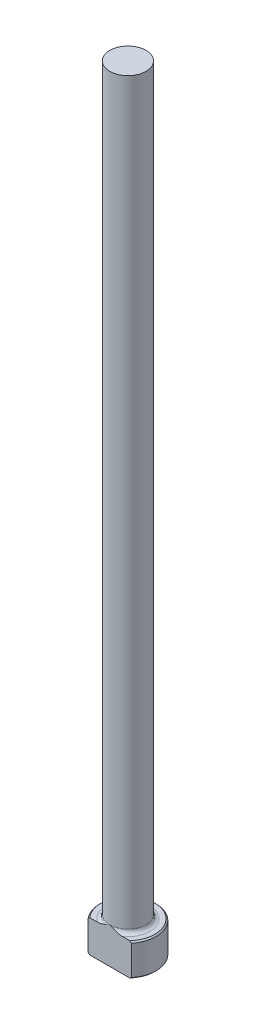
ISO-10303-21;
HEADER;
FILE_DESCRIPTION(('STEP AP214'),'2;1');
FILE_NAME('part.step','',(''),(''),'','','');
FILE_SCHEMA(('AUTOMOTIVE_DESIGN { 1 0 10303 214 1 1 1 1 }'));
ENDSEC;
DATA;
#1=APPLICATION_CONTEXT('core data for automotive mechanical design processes');
#2=APPLICATION_PROTOCOL_DEFINITION('international standard','automotive_design',2000,#1);
#3=PRODUCT_CONTEXT('',#1,'mechanical');
#4=PRODUCT('Part','Part','',(#3));
#5=PRODUCT_RELATED_PRODUCT_CATEGORY('part','',(#4));
#6=PRODUCT_DEFINITION_FORMATION('','',#4);
#7=PRODUCT_DEFINITION_CONTEXT('part definition',#1,'design');
#8=PRODUCT_DEFINITION('design','',#6,#7);
#9=PRODUCT_DEFINITION_SHAPE('','',#8);
#10=(LENGTH_UNIT() NAMED_UNIT(*) SI_UNIT(.MILLI.,.METRE.));
#11=(NAMED_UNIT(*) PLANE_ANGLE_UNIT() SI_UNIT($,.RADIAN.));
#12=(NAMED_UNIT(*) SI_UNIT($,.STERADIAN.) SOLID_ANGLE_UNIT());
#13=UNCERTAINTY_MEASURE_WITH_UNIT(LENGTH_MEASURE(1.E-05),#10,'distance_accuracy_value','');
#14=(GEOMETRIC_REPRESENTATION_CONTEXT(3) GLOBAL_UNCERTAINTY_ASSIGNED_CONTEXT((#13)) GLOBAL_UNIT_ASSIGNED_CONTEXT((#10,
#11,#12)) REPRESENTATION_CONTEXT('',''));
#15=CARTESIAN_POINT('',(0.,0.,0.));
#16=DIRECTION('',(0.,0.,1.));
#17=DIRECTION('',(1.,0.,0.));
#18=AXIS2_PLACEMENT_3D('',#15,#16,#17);
#19=CARTESIAN_POINT('',(0.,0.,0.));
#20=DIRECTION('',(0.,-1.,0.));
#21=DIRECTION('',(0.,0.,-1.));
#22=AXIS2_PLACEMENT_3D('',#19,#20,#21);
#23=PLANE('',#22);
#24=DIRECTION('',(1.,0.,0.));
#25=VECTOR('',#24,1.);
#26=CARTESIAN_POINT('',(-4.24825080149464,0.,3.57123999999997));
#27=LINE('',#26,#25);
#28=CARTESIAN_POINT('',(-3.9106011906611,0.,3.57123999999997));
#29=VERTEX_POINT('',#28);
#30=CARTESIAN_POINT('',(3.9106011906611,0.,3.57123999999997));
#31=VERTEX_POINT('',#30);
#32=EDGE_CURVE('E92',#29,#31,#27,.T.);
#33=ORIENTED_EDGE('',*,*,#32,.F.);
#34=CARTESIAN_POINT('',(0.,0.,0.));
#35=DIRECTION('',(0.,-1.,0.));
#36=DIRECTION('',(0.,0.,-1.));
#37=AXIS2_PLACEMENT_3D('',#34,#35,#36);
#38=CIRCLE('',#37,5.29589999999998);
#39=EDGE_CURVE('E105',#29,#31,#38,.T.);
#40=ORIENTED_EDGE('',*,*,#39,.T.);
#41=EDGE_LOOP('',(#33,#40));
#42=FACE_BOUND('',#41,.T.);
#43=ADVANCED_FACE('F37',(#42),#23,.T.);
#44=CARTESIAN_POINT('',(0.,259.958771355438,0.));
#45=DIRECTION('',(0.,1.,0.));
#46=DIRECTION('',(0.,0.,1.));
#47=AXIS2_PLACEMENT_3D('',#44,#45,#46);
#48=CYLINDRICAL_SURFACE('',#47,5.54989999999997);
#49=DIRECTION('',(0.,-1.,0.));
#50=VECTOR('',#49,1.);
#51=CARTESIAN_POINT('',(-4.24825080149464,152.4,3.57123999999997));
#52=LINE('',#51,#50);
#53=CARTESIAN_POINT('',(-4.24825080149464,6.09599999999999,3.57123999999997));
#54=VERTEX_POINT('',#53);
#55=CARTESIAN_POINT('',(-4.24825080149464,0.253999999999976,3.57123999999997));
#56=VERTEX_POINT('',#55);
#57=EDGE_CURVE('E95',#54,#56,#52,.T.);
#58=ORIENTED_EDGE('',*,*,#57,.F.);
#59=CARTESIAN_POINT('',(0.,6.09599999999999,0.));
#60=DIRECTION('',(0.,1.,0.));
#61=DIRECTION('',(0.,0.,1.));
#62=AXIS2_PLACEMENT_3D('',#59,#60,#61);
#63=CIRCLE('',#62,5.54989999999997);
#64=CARTESIAN_POINT('',(4.24825080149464,6.09599999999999,3.57123999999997));
#65=VERTEX_POINT('',#64);
#66=EDGE_CURVE('E109',#54,#65,#63,.F.);
#67=ORIENTED_EDGE('',*,*,#66,.T.);
#68=DIRECTION('',(0.,-1.,0.));
#69=VECTOR('',#68,1.);
#70=CARTESIAN_POINT('',(4.24825080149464,152.4,3.57123999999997));
#71=LINE('',#70,#69);
#72=CARTESIAN_POINT('',(4.24825080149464,0.253999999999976,3.57123999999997));
#73=VERTEX_POINT('',#72);
#74=EDGE_CURVE('E187',#65,#73,#71,.T.);
#75=ORIENTED_EDGE('',*,*,#74,.T.);
#76=CARTESIAN_POINT('',(0.,0.253999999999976,0.));
#77=DIRECTION('',(0.,-1.,0.));
#78=DIRECTION('',(0.,0.,-1.));
#79=AXIS2_PLACEMENT_3D('',#76,#77,#78);
#80=CIRCLE('',#79,5.54989999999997);
#81=EDGE_CURVE('E115',#73,#56,#80,.F.);
#82=ORIENTED_EDGE('',*,*,#81,.T.);
#83=EDGE_LOOP('',(#58,#67,#75,#82));
#84=FACE_BOUND('',#83,.T.);
#85=ADVANCED_FACE('F160',(#84),#48,.T.);
#86=CARTESIAN_POINT('',(-5.54989999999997,6.35,0.));
#87=DIRECTION('',(0.,1.,0.));
#88=DIRECTION('',(0.,0.,1.));
#89=AXIS2_PLACEMENT_3D('',#86,#87,#88);
#90=PLANE('',#89);
#91=DIRECTION('',(-1.,0.,0.));
#92=VECTOR('',#91,1.);
#93=CARTESIAN_POINT('',(-5.54989999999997,6.35,3.57123999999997));
#94=LINE('',#93,#92);
#95=CARTESIAN_POINT('',(3.91060119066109,6.35,3.57123999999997));
#96=VERTEX_POINT('',#95);
#97=CARTESIAN_POINT('',(2.4542236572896,6.35,3.57123999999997));
#98=VERTEX_POINT('',#97);
#99=EDGE_CURVE('E58',#96,#98,#94,.T.);
#100=ORIENTED_EDGE('',*,*,#99,.F.);
#101=CARTESIAN_POINT('',(0.,6.35,0.));
#102=DIRECTION('',(0.,1.,0.));
#103=DIRECTION('',(0.,0.,1.));
#104=AXIS2_PLACEMENT_3D('',#101,#102,#103);
#105=CIRCLE('',#104,5.29589999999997);
#106=CARTESIAN_POINT('',(-3.91060119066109,6.35,3.57123999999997));
#107=VERTEX_POINT('',#106);
#108=EDGE_CURVE('E182',#96,#107,#105,.T.);
#109=ORIENTED_EDGE('',*,*,#108,.T.);
#110=CARTESIAN_POINT('',(-2.45422365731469,6.35000000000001,3.57123999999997));
#111=VERTEX_POINT('',#110);
#112=EDGE_CURVE('E140',#111,#107,#94,.T.);
#113=ORIENTED_EDGE('',*,*,#112,.F.);
#114=CARTESIAN_POINT('',(0.,6.35,0.));
#115=DIRECTION('',(0.,1.,0.));
#116=DIRECTION('',(0.,0.,1.));
#117=AXIS2_PLACEMENT_3D('',#114,#115,#116);
#118=CIRCLE('',#117,4.33323999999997);
#119=EDGE_CURVE('E112',#111,#98,#118,.F.);
#120=ORIENTED_EDGE('',*,*,#119,.T.);
#121=EDGE_LOOP('',(#100,#109,#113,#120));
#122=FACE_BOUND('',#121,.T.);
#123=ADVANCED_FACE('F164',(#122),#90,.T.);
#124=CARTESIAN_POINT('',(0.,259.958771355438,0.));
#125=DIRECTION('',(0.,1.,0.));
#126=DIRECTION('',(0.,0.,1.));
#127=AXIS2_PLACEMENT_3D('',#124,#125,#126);
#128=CYLINDRICAL_SURFACE('',#127,3.57123999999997);
#129=CARTESIAN_POINT('',(0.,7.11200000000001,0.));
#130=DIRECTION('',(0.,1.,0.));
#131=DIRECTION('',(0.,0.,1.));
#132=AXIS2_PLACEMENT_3D('',#129,#130,#131);
#133=CIRCLE('',#132,3.57123999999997);
#134=CARTESIAN_POINT('',(0.,7.11200000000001,3.57123999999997));
#135=VERTEX_POINT('',#134);
#136=EDGE_CURVE('E108',#135,#135,#133,.T.);
#137=ORIENTED_EDGE('',*,*,#136,.T.);
#138=EDGE_LOOP('',(#137));
#139=FACE_BOUND('',#138,.T.);
#140=CARTESIAN_POINT('',(0.,152.4,0.));
#141=DIRECTION('',(0.,1.,0.));
#142=DIRECTION('',(0.,0.,1.));
#143=AXIS2_PLACEMENT_3D('',#140,#141,#142);
#144=CIRCLE('',#143,3.57123999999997);
#145=CARTESIAN_POINT('',(0.,152.4,3.57123999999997));
#146=VERTEX_POINT('',#145);
#147=EDGE_CURVE('E100',#146,#146,#144,.T.);
#148=ORIENTED_EDGE('',*,*,#147,.F.);
#149=EDGE_LOOP('',(#148));
#150=FACE_BOUND('',#149,.T.);
#151=ADVANCED_FACE('F169',(#139,#150),#128,.T.);
#152=CARTESIAN_POINT('',(-3.57123999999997,152.4,0.));
#153=DIRECTION('',(0.,1.,0.));
#154=DIRECTION('',(0.,0.,1.));
#155=AXIS2_PLACEMENT_3D('',#152,#153,#154);
#156=PLANE('',#155);
#157=ORIENTED_EDGE('',*,*,#147,.T.);
#158=EDGE_LOOP('',(#157));
#159=FACE_BOUND('',#158,.T.);
#160=ADVANCED_FACE('F127',(#159),#156,.T.);
#161=CARTESIAN_POINT('',(0.,6.35000000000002,0.));
#162=DIRECTION('',(0.,-1.,0.));
#163=DIRECTION('',(0.,0.,-1.));
#164=AXIS2_PLACEMENT_3D('',#161,#162,#163);
#165=CONICAL_SURFACE('',#164,5.29589999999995,0.785398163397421);
#166=CARTESIAN_POINT('',(4.24895080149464,6.095464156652,3.57123999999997));
#167=CARTESIAN_POINT('',(4.14438295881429,6.17549355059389,3.57123999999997));
#168=CARTESIAN_POINT('',(4.03923647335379,6.25477935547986,3.57123999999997));
#169=CARTESIAN_POINT('',(3.82754644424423,6.41151858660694,3.57123999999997));
#170=CARTESIAN_POINT('',(3.72100255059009,6.48897153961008,3.57123999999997));
#171=CARTESIAN_POINT('',(3.50542882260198,6.64230038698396,3.57123999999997));
#172=CARTESIAN_POINT('',(3.39638561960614,6.71815755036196,3.57123999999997));
#173=CARTESIAN_POINT('',(3.17642983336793,6.86710220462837,3.57123999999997));
#174=CARTESIAN_POINT('',(3.06551738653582,6.94018989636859,3.57123999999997));
#175=CARTESIAN_POINT('',(2.83424004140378,7.08758688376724,3.57123999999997));
#176=CARTESIAN_POINT('',(2.71372876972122,7.16166773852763,3.57123999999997));
#177=CARTESIAN_POINT('',(2.46979024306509,7.30494728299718,3.57123999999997));
#178=CARTESIAN_POINT('',(2.34636247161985,7.37414509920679,3.57123999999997));
#179=CARTESIAN_POINT('',(2.09658186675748,7.5060691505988,3.57123999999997));
#180=CARTESIAN_POINT('',(1.9702398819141,7.56881574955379,3.57123999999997));
#181=CARTESIAN_POINT('',(1.7139227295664,7.68631362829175,3.57123999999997));
#182=CARTESIAN_POINT('',(1.58394942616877,7.74106892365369,3.57123999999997));
#183=CARTESIAN_POINT('',(1.32618995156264,7.83815050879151,3.57123999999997));
#184=CARTESIAN_POINT('',(1.19857765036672,7.88093225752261,3.57123999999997));
#185=CARTESIAN_POINT('',(0.940022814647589,7.95508927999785,3.57123999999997));
#186=CARTESIAN_POINT('',(0.809080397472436,7.98646495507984,3.57123999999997));
#187=CARTESIAN_POINT('',(0.547472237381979,8.0351736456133,3.57123999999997));
#188=CARTESIAN_POINT('',(0.416861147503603,8.05279424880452,3.57123999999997));
#189=CARTESIAN_POINT('',(0.154490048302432,8.07371003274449,3.57123999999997));
#190=CARTESIAN_POINT('',(0.022730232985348,8.07700758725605,3.57123999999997));
#191=CARTESIAN_POINT('',(-0.240736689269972,8.06898614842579,3.57123999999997));
#192=CARTESIAN_POINT('',(-0.372442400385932,8.0576223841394,3.57123999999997));
#193=CARTESIAN_POINT('',(-0.633923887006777,8.02114818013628,3.57123999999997));
#194=CARTESIAN_POINT('',(-0.76369917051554,7.99603429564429,3.57123999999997));
#195=CARTESIAN_POINT('',(-1.02309539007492,7.93318144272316,3.57123999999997));
#196=CARTESIAN_POINT('',(-1.15265132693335,7.89517926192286,3.57123999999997));
#197=CARTESIAN_POINT('',(-1.40824532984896,7.80891935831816,3.57123999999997));
#198=CARTESIAN_POINT('',(-1.53428336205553,7.76066153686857,3.57123999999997));
#199=CARTESIAN_POINT('',(-1.77961438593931,7.65732551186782,3.57123999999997));
#200=CARTESIAN_POINT('',(-1.89899757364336,7.60245871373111,3.57123999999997));
#201=CARTESIAN_POINT('',(-2.1347403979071,7.48653307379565,3.57123999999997));
#202=CARTESIAN_POINT('',(-2.25109902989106,7.425472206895,3.57123999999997));
#203=CARTESIAN_POINT('',(-2.48132613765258,7.29831352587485,3.57123999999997));
#204=CARTESIAN_POINT('',(-2.59518895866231,7.23220554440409,3.57123999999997));
#205=CARTESIAN_POINT('',(-2.82053768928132,7.09605075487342,3.57123999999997));
#206=CARTESIAN_POINT('',(-2.93202336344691,7.02600355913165,3.57123999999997));
#207=CARTESIAN_POINT('',(-3.14635218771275,6.88700950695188,3.57123999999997));
#208=CARTESIAN_POINT('',(-3.24931455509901,6.8182456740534,3.57123999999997));
#209=CARTESIAN_POINT('',(-3.45366191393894,6.67840684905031,3.57123999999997));
#210=CARTESIAN_POINT('',(-3.55504682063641,6.60733173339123,3.57123999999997));
#211=CARTESIAN_POINT('',(-3.75586493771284,6.46368301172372,3.57123999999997));
#212=CARTESIAN_POINT('',(-3.85530602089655,6.39112037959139,3.57123999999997));
#213=CARTESIAN_POINT('',(-4.05298379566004,6.24441065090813,3.57123999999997));
#214=CARTESIAN_POINT('',(-4.15122071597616,6.17026386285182,3.57123999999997));
#215=CARTESIAN_POINT('',(-4.24895080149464,6.095464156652,3.57123999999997));
#216=B_SPLINE_CURVE_WITH_KNOTS('',3,(#166,#167,#168,#169,#170,#171,#172,#173,#174,#175,#176,
#177,#178,#179,#180,#181,#182,#183,#184,#185,#186,#187,#188,#189,#190,#191,#192,#193,#194,#195,
#196,#197,#198,#199,#200,#201,#202,#203,#204,#205,#206,#207,#208,#209,#210,#211,#212,#213,#214,
#215),.UNSPECIFIED.,.F.,.F.,(4,2,2,2,2,2,2,2,2,2,2,2,2,2,2,2,2,2,2,2,2,2,2,2,4),(0.,
0.395042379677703,0.790185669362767,1.18865071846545,1.58708681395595,2.01137547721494,
2.43573984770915,2.85872066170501,3.28148819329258,3.68483203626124,4.08816168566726,
4.48281421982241,4.87740134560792,5.27319627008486,5.66909039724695,6.07361229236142,
6.47813807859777,6.87208323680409,7.2661576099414,7.66104792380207,8.0559771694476,
8.42738035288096,8.79880342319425,9.16808958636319,9.53730447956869),.UNSPECIFIED.);
#217=EDGE_CURVE('E63',#65,#96,#216,.T.);
#218=ORIENTED_EDGE('',*,*,#217,.F.);
#219=ORIENTED_EDGE('',*,*,#66,.F.);
#220=EDGE_CURVE('E133',#107,#54,#216,.T.);
#221=ORIENTED_EDGE('',*,*,#220,.F.);
#222=ORIENTED_EDGE('',*,*,#108,.F.);
#223=EDGE_LOOP('',(#218,#219,#221,#222));
#224=FACE_BOUND('',#223,.T.);
#225=ADVANCED_FACE('F147',(#224),#165,.T.);
#226=CARTESIAN_POINT('',(0.,0.253999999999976,0.));
#227=DIRECTION('',(0.,1.,0.));
#228=DIRECTION('',(0.,0.,1.));
#229=AXIS2_PLACEMENT_3D('',#226,#227,#228);
#230=CONICAL_SURFACE('',#229,5.54989999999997,0.785398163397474);
#231=CARTESIAN_POINT('',(-4.24895080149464,0.254535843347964,3.57123999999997));
#232=CARTESIAN_POINT('',(-4.14438295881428,0.174506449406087,3.57123999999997));
#233=CARTESIAN_POINT('',(-4.03923647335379,0.0952206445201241,3.57123999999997));
#234=CARTESIAN_POINT('',(-3.82754644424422,-0.0615185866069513,3.57123999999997));
#235=CARTESIAN_POINT('',(-3.72100255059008,-0.138971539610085,3.57123999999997));
#236=CARTESIAN_POINT('',(-3.50542882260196,-0.292300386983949,3.57123999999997));
#237=CARTESIAN_POINT('',(-3.39638561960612,-0.368157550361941,3.57123999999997));
#238=CARTESIAN_POINT('',(-3.1764298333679,-0.517102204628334,3.57123999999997));
#239=CARTESIAN_POINT('',(-3.06551738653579,-0.590189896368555,3.57123999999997));
#240=CARTESIAN_POINT('',(-2.83424004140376,-0.737586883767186,3.57123999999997));
#241=CARTESIAN_POINT('',(-2.71372876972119,-0.811667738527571,3.57123999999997));
#242=CARTESIAN_POINT('',(-2.46979024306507,-0.954947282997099,3.57123999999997));
#243=CARTESIAN_POINT('',(-2.34636247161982,-1.0241450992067,3.57123999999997));
#244=CARTESIAN_POINT('',(-2.09658186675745,-1.1560691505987,3.57123999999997));
#245=CARTESIAN_POINT('',(-1.97023988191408,-1.21881574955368,3.57123999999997));
#246=CARTESIAN_POINT('',(-1.71392272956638,-1.33631362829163,3.57123999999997));
#247=CARTESIAN_POINT('',(-1.58394942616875,-1.39106892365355,3.57123999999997));
#248=CARTESIAN_POINT('',(-1.32618995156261,-1.48815050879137,3.57123999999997));
#249=CARTESIAN_POINT('',(-1.19857765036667,-1.53093225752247,3.57123999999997));
#250=CARTESIAN_POINT('',(-0.940022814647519,-1.60508927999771,3.57123999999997));
#251=CARTESIAN_POINT('',(-0.809080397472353,-1.63646495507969,3.57123999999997));
#252=CARTESIAN_POINT('',(-0.54747223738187,-1.68517364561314,3.57123999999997));
#253=CARTESIAN_POINT('',(-0.416861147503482,-1.70279424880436,3.57123999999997));
#254=CARTESIAN_POINT('',(-0.154490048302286,-1.72371003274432,3.57123999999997));
#255=CARTESIAN_POINT('',(-0.0227302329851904,-1.72700758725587,3.57123999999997));
#256=CARTESIAN_POINT('',(0.240736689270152,-1.7189861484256,3.57123999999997));
#257=CARTESIAN_POINT('',(0.372442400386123,-1.70762238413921,3.57123999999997));
#258=CARTESIAN_POINT('',(0.633923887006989,-1.67114818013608,3.57123999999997));
#259=CARTESIAN_POINT('',(0.763699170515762,-1.64603429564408,3.57123999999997));
#260=CARTESIAN_POINT('',(1.02309539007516,-1.58318144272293,3.57123999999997));
#261=CARTESIAN_POINT('',(1.15265132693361,-1.54517926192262,3.57123999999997));
#262=CARTESIAN_POINT('',(1.40824532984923,-1.45891935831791,3.57123999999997));
#263=CARTESIAN_POINT('',(1.53428336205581,-1.41066153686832,3.57123999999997));
#264=CARTESIAN_POINT('',(1.77961438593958,-1.30732551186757,3.57123999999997));
#265=CARTESIAN_POINT('',(1.89899757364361,-1.25245871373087,3.57123999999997));
#266=CARTESIAN_POINT('',(2.13474039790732,-1.13653307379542,3.57123999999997));
#267=CARTESIAN_POINT('',(2.25109902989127,-1.07547220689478,3.57123999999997));
#268=CARTESIAN_POINT('',(2.48132613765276,-0.948313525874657,3.57123999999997));
#269=CARTESIAN_POINT('',(2.59518895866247,-0.882205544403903,3.57123999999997));
#270=CARTESIAN_POINT('',(2.82053768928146,-0.746050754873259,3.57123999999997));
#271=CARTESIAN_POINT('',(2.93202336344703,-0.67600355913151,3.57123999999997));
#272=CARTESIAN_POINT('',(3.14635218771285,-0.537009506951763,3.57123999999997));
#273=CARTESIAN_POINT('',(3.24931455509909,-0.468245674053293,3.57123999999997));
#274=CARTESIAN_POINT('',(3.453661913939,-0.328406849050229,3.57123999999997));
#275=CARTESIAN_POINT('',(3.55504682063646,-0.257331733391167,3.57123999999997));
#276=CARTESIAN_POINT('',(3.75586493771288,-0.113683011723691,3.57123999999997));
#277=CARTESIAN_POINT('',(3.85530602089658,-0.041120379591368,3.57123999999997));
#278=CARTESIAN_POINT('',(4.05298379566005,0.105589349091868,3.57123999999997));
#279=CARTESIAN_POINT('',(4.15122071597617,0.179736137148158,3.57123999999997));
#280=CARTESIAN_POINT('',(4.24895080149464,0.254535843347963,3.57123999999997));
#281=B_SPLINE_CURVE_WITH_KNOTS('',3,(#231,#232,#233,#234,#235,#236,#237,#238,#239,#240,#241,
#242,#243,#244,#245,#246,#247,#248,#249,#250,#251,#252,#253,#254,#255,#256,#257,#258,#259,#260,
#261,#262,#263,#264,#265,#266,#267,#268,#269,#270,#271,#272,#273,#274,#275,#276,#277,#278,#279,
#280),.UNSPECIFIED.,.F.,.F.,(4,2,2,2,2,2,2,2,2,2,2,2,2,2,2,2,2,2,2,2,2,2,2,2,4),(0.,
0.395042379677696,0.790185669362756,1.18865071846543,1.58708681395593,2.01137547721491,
2.4357398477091,2.85872066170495,3.28148819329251,3.6848320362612,4.08816168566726,
4.48281421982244,4.87740134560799,5.27319627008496,5.66909039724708,6.07361229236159,
6.47813807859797,6.87208323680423,7.26615760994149,7.66104792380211,8.05597716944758,
8.42738035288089,8.79880342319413,9.16808958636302,9.53730447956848),.UNSPECIFIED.);
#282=EDGE_CURVE('E89',#56,#29,#281,.T.);
#283=ORIENTED_EDGE('',*,*,#282,.F.);
#284=ORIENTED_EDGE('',*,*,#81,.F.);
#285=EDGE_CURVE('E101',#31,#73,#281,.T.);
#286=ORIENTED_EDGE('',*,*,#285,.F.);
#287=ORIENTED_EDGE('',*,*,#39,.F.);
#288=EDGE_LOOP('',(#283,#284,#286,#287));
#289=FACE_BOUND('',#288,.T.);
#290=ADVANCED_FACE('F107',(#289),#230,.T.);
#291=CARTESIAN_POINT('',(0.,7.11200000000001,0.));
#292=DIRECTION('',(0.,1.,0.));
#293=DIRECTION('',(0.,0.,1.));
#294=AXIS2_PLACEMENT_3D('',#291,#292,#293);
#295=TOROIDAL_SURFACE('',#294,4.33323999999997,0.762);
#296=ORIENTED_EDGE('',*,*,#119,.F.);
#297=CARTESIAN_POINT('',(0.,7.11200000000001,3.57123999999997));
#298=CARTESIAN_POINT('',(5.01521697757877E-13,7.11200100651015,3.57123999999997));
#299=CARTESIAN_POINT('',(-1.76590739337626E-07,7.11200201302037,3.57123999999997));
#300=CARTESIAN_POINT('',(-7.55286765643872E-07,7.11200396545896,3.57123999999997));
#301=CARTESIAN_POINT('',(-1.16131545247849E-06,7.11200491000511,3.57123999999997));
#302=CARTESIAN_POINT('',(-2.14347150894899E-06,7.1120067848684,3.57123999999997));
#303=CARTESIAN_POINT('',(-2.72908456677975E-06,7.1120077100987,3.57123999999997));
#304=CARTESIAN_POINT('',(-4.00559807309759E-06,7.11200947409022,3.57123999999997));
#305=CARTESIAN_POINT('',(-4.69593042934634E-06,7.11201031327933,3.57123999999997));
#306=CARTESIAN_POINT('',(-7.12798779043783E-06,7.1120130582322,3.57123999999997));
#307=CARTESIAN_POINT('',(-9.00885578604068E-06,7.11201484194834,3.57123999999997));
#308=CARTESIAN_POINT('',(-1.29410398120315E-05,7.11201807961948,3.57123999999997));
#309=CARTESIAN_POINT('',(-1.49866128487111E-05,7.11201954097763,3.57123999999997));
#310=CARTESIAN_POINT('',(-2.27853159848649E-05,7.11202486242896,3.57123999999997));
#311=CARTESIAN_POINT('',(-2.87443387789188E-05,7.11202843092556,3.57123999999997));
#312=CARTESIAN_POINT('',(-4.06410352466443E-05,7.11203442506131,3.57123999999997));
#313=CARTESIAN_POINT('',(-4.65470368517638E-05,7.11203691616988,3.57123999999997));
#314=CARTESIAN_POINT('',(-7.11711037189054E-05,7.11204719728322,3.57123999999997));
#315=CARTESIAN_POINT('',(-8.99605831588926E-05,7.11205478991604,3.57123999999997));
#316=CARTESIAN_POINT('',(-0.00012545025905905,7.11206727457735,3.57123999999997));
#317=CARTESIAN_POINT('',(-0.000142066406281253,7.1120723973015,3.57123999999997));
#318=CARTESIAN_POINT('',(-0.000260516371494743,7.11211213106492,3.57123999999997));
#319=CARTESIAN_POINT('',(-0.00035660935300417,7.1121616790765,3.57123999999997));
#320=CARTESIAN_POINT('',(-0.000727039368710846,7.1123455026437,3.57123999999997));
#321=CARTESIAN_POINT('',(-0.001005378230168,7.11246868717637,3.57123999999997));
#322=CARTESIAN_POINT('',(-0.00207465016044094,7.11294918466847,3.57123999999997));
#323=CARTESIAN_POINT('',(-0.00286145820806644,7.11331811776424,3.57123999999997));
#324=CARTESIAN_POINT('',(-0.00604597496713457,7.11480388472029,3.57123999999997));
#325=CARTESIAN_POINT('',(-0.00844825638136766,7.11590763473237,3.57123999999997));
#326=CARTESIAN_POINT('',(-0.0421206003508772,7.13138817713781,3.57123999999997));
#327=CARTESIAN_POINT('',(-0.0733565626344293,7.1458632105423,3.57123999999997));
#328=CARTESIAN_POINT('',(-0.136296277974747,7.1749208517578,3.57123999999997));
#329=CARTESIAN_POINT('',(-0.168000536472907,7.18950218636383,3.57123999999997));
#330=CARTESIAN_POINT('',(-0.26049771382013,7.23192483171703,3.57123999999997));
#331=CARTESIAN_POINT('',(-0.321333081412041,7.2596772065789,3.57123999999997));
#332=CARTESIAN_POINT('',(-0.450063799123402,7.3176989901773,3.57123999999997));
#333=CARTESIAN_POINT('',(-0.517988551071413,7.34790319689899,3.57123999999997));
#334=CARTESIAN_POINT('',(-0.654961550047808,7.40755967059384,3.57123999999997));
#335=CARTESIAN_POINT('',(-0.724014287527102,7.4370016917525,3.57123999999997));
#336=CARTESIAN_POINT('',(-0.845579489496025,7.48730903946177,3.57123999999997));
#337=CARTESIAN_POINT('',(-0.897958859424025,7.5084946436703,3.57123999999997));
#338=CARTESIAN_POINT('',(-1.00299625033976,7.54979079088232,3.57123999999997));
#339=CARTESIAN_POINT('',(-1.05565332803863,7.56990374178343,3.57123999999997));
#340=CARTESIAN_POINT('',(-1.21212759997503,7.62761302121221,3.57123999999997));
#341=CARTESIAN_POINT('',(-1.31659809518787,7.66348622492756,3.57123999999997));
#342=CARTESIAN_POINT('',(-1.49278330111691,7.71807663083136,3.57123999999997));
#343=CARTESIAN_POINT('',(-1.56395183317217,7.73855254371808,3.57123999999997));
#344=CARTESIAN_POINT('',(-1.70759150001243,7.77611793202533,3.57123999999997));
#345=CARTESIAN_POINT('',(-1.78006754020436,7.79318887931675,3.57123999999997));
#346=CARTESIAN_POINT('',(-1.9296081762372,7.82384868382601,3.57123999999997));
#347=CARTESIAN_POINT('',(-2.00671897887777,7.83721686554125,3.57123999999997));
#348=CARTESIAN_POINT('',(-2.16170557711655,7.85827154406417,3.57123999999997));
#349=CARTESIAN_POINT('',(-2.23958110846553,7.86595993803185,3.57123999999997));
#350=CARTESIAN_POINT('',(-2.41316458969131,7.87541912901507,3.57123999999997));
#351=CARTESIAN_POINT('',(-2.50897971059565,7.87548974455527,3.57123999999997));
#352=CARTESIAN_POINT('',(-2.69873879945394,7.86266617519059,3.57123999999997));
#353=CARTESIAN_POINT('',(-2.79269122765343,7.84993298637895,3.57123999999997));
#354=CARTESIAN_POINT('',(-2.94834629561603,7.81478970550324,3.57123999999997));
#355=CARTESIAN_POINT('',(-3.01099313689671,7.79661956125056,3.57123999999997));
#356=CARTESIAN_POINT('',(-3.13311783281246,7.75119466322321,3.57123999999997));
#357=CARTESIAN_POINT('',(-3.19259303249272,7.72393243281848,3.57123999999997));
#358=CARTESIAN_POINT('',(-3.2895229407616,7.66822810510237,3.57123999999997));
#359=CARTESIAN_POINT('',(-3.32843006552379,7.64232613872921,3.57123999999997));
#360=CARTESIAN_POINT('',(-3.40175541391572,7.58480019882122,3.57123999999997));
#361=CARTESIAN_POINT('',(-3.43618193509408,7.55318706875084,3.57123999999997));
#362=CARTESIAN_POINT('',(-3.49199473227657,7.49158316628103,3.57123999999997));
#363=CARTESIAN_POINT('',(-3.5145944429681,7.4626970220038,3.57123999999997));
#364=CARTESIAN_POINT('',(-3.55479974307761,7.40160169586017,3.57123999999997));
#365=CARTESIAN_POINT('',(-3.57240720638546,7.36939376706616,3.57123999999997));
#366=CARTESIAN_POINT('',(-3.60162953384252,7.30200115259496,3.57123999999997));
#367=CARTESIAN_POINT('',(-3.61319239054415,7.26679356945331,3.57123999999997));
#368=CARTESIAN_POINT('',(-3.62914546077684,7.19478844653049,3.57123999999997));
#369=CARTESIAN_POINT('',(-3.63354215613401,7.15799237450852,3.57123999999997));
#370=CARTESIAN_POINT('',(-3.6347021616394,7.08938239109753,3.57123999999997));
#371=CARTESIAN_POINT('',(-3.63243477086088,7.05758138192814,3.57123999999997));
#372=CARTESIAN_POINT('',(-3.62246065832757,6.99485289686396,3.57123999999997));
#373=CARTESIAN_POINT('',(-3.614754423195,6.96392534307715,3.57123999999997));
#374=CARTESIAN_POINT('',(-3.59460534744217,6.90439360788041,3.57123999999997));
#375=CARTESIAN_POINT('',(-3.5822644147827,6.87575447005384,3.57123999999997));
#376=CARTESIAN_POINT('',(-3.55348648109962,6.82063145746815,3.57123999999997));
#377=CARTESIAN_POINT('',(-3.53704806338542,6.79414833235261,3.57123999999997));
#378=CARTESIAN_POINT('',(-3.49338312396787,6.73337952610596,3.57123999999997));
#379=CARTESIAN_POINT('',(-3.4644863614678,6.70029184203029,3.57123999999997));
#380=CARTESIAN_POINT('',(-3.40170527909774,6.63922321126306,3.57123999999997));
#381=CARTESIAN_POINT('',(-3.3678091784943,6.61125468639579,3.57123999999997));
#382=CARTESIAN_POINT('',(-3.28195465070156,6.54991490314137,3.57123999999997));
#383=CARTESIAN_POINT('',(-3.22826146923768,6.51898089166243,3.57123999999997));
#384=CARTESIAN_POINT('',(-3.11685649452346,6.4659881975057,3.57123999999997));
#385=CARTESIAN_POINT('',(-3.05914651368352,6.44392554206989,3.57123999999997));
#386=CARTESIAN_POINT('',(-2.90895675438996,6.397325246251,3.57123999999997));
#387=CARTESIAN_POINT('',(-2.81483745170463,6.37812048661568,3.57123999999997));
#388=CARTESIAN_POINT('',(-2.62379203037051,6.35393265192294,3.57123999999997));
#389=CARTESIAN_POINT('',(-2.52684524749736,6.34914127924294,3.57123999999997));
#390=CARTESIAN_POINT('',(-2.34175764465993,6.35101691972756,3.57123999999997));
#391=CARTESIAN_POINT('',(-2.25359864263,6.35670506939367,3.57123999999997));
#392=CARTESIAN_POINT('',(-2.07796266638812,6.37582328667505,3.57123999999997));
#393=CARTESIAN_POINT('',(-1.99048774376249,6.38927124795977,3.57123999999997));
#394=CARTESIAN_POINT('',(-1.82119356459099,6.42156125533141,3.57123999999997));
#395=CARTESIAN_POINT('',(-1.73931346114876,6.4400930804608,3.57123999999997));
#396=CARTESIAN_POINT('',(-1.57721134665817,6.48159818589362,3.57123999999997));
#397=CARTESIAN_POINT('',(-1.4969824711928,6.50454506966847,3.57123999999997));
#398=CARTESIAN_POINT('',(-1.31237017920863,6.56193110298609,3.57123999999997));
#399=CARTESIAN_POINT('',(-1.20840446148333,6.59770595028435,3.57123999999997));
#400=CARTESIAN_POINT('',(-1.05265881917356,6.6552295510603,3.57123999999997));
#401=CARTESIAN_POINT('',(-1.00023402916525,6.67527678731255,3.57123999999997));
#402=CARTESIAN_POINT('',(-0.895657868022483,6.71642939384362,3.57123999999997));
#403=CARTESIAN_POINT('',(-0.843507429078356,6.7375371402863,3.57123999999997));
#404=CARTESIAN_POINT('',(-0.7223348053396,6.78770883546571,3.57123999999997));
#405=CARTESIAN_POINT('',(-0.653445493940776,6.81709241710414,3.57123999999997));
#406=CARTESIAN_POINT('',(-0.516794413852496,6.87662522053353,3.57123999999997));
#407=CARTESIAN_POINT('',(-0.449028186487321,6.90676427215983,3.57123999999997));
#408=CARTESIAN_POINT('',(-0.320599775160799,6.96465641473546,3.57123999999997));
#409=CARTESIAN_POINT('',(-0.25990837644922,6.99234472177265,3.57123999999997));
#410=CARTESIAN_POINT('',(-0.167629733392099,7.03466840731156,3.57123999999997));
#411=CARTESIAN_POINT('',(-0.136000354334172,7.04921552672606,3.57123999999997));
#412=CARTESIAN_POINT('',(-0.0732091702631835,7.07820481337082,3.57123999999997));
#413=CARTESIAN_POINT('',(-0.0420468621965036,7.09264571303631,3.57123999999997));
#414=CARTESIAN_POINT('',(-0.00844824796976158,7.10809236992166,3.57123999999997));
#415=CARTESIAN_POINT('',(-0.00604595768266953,7.10919612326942,3.57123999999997));
#416=CARTESIAN_POINT('',(-0.00286143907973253,7.11068189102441,3.57123999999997));
#417=CARTESIAN_POINT('',(-0.00207463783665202,7.11105082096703,3.57123999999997));
#418=CARTESIAN_POINT('',(-0.00100537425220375,7.11153131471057,3.57123999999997));
#419=CARTESIAN_POINT('',(-0.000727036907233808,7.11165449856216,3.57123999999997));
#420=CARTESIAN_POINT('',(-0.000356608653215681,7.11183832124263,3.57123999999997));
#421=CARTESIAN_POINT('',(-0.000260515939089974,7.11188786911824,3.57123999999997));
#422=CARTESIAN_POINT('',(-0.000142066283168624,7.1119276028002,3.57123999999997));
#423=CARTESIAN_POINT('',(-0.000125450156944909,7.1119327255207,3.57123999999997));
#424=CARTESIAN_POINT('',(-8.99605261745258E-05,7.1119452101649,3.57123999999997));
#425=CARTESIAN_POINT('',(-7.11710702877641E-05,7.11195280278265,3.57123999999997));
#426=CARTESIAN_POINT('',(-4.65470297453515E-05,7.11196308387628,3.57123999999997));
#427=CARTESIAN_POINT('',(-4.06410314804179E-05,7.11196557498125,3.57123999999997));
#428=CARTESIAN_POINT('',(-2.87443410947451E-05,7.11197156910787,3.57123999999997));
#429=CARTESIAN_POINT('',(-2.27853209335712E-05,7.11197513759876,3.57123999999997));
#430=CARTESIAN_POINT('',(-1.49866201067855E-05,7.11198045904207,3.57123999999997));
#431=CARTESIAN_POINT('',(-1.29410472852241E-05,7.11198192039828,3.57123999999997));
#432=CARTESIAN_POINT('',(-9.00886329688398E-06,7.11198515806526,3.57123999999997));
#433=CARTESIAN_POINT('',(-7.12799510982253E-06,7.11198694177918,3.57123999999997));
#434=CARTESIAN_POINT('',(-4.69593701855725E-06,7.11198968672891,3.57123999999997));
#435=CARTESIAN_POINT('',(-4.00560436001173E-06,7.11199052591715,3.57123999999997));
#436=CARTESIAN_POINT('',(-2.72909009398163E-06,7.1119922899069,3.57123999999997));
#437=CARTESIAN_POINT('',(-2.1434765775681E-06,7.11199321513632,3.57123999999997));
#438=CARTESIAN_POINT('',(-1.16131942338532E-06,7.11199508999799,3.57123999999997));
#439=CARTESIAN_POINT('',(-7.55290113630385E-07,7.11199603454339,3.57123999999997));
#440=CARTESIAN_POINT('',(-1.76592600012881E-07,7.11199798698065,3.57123999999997));
#441=CARTESIAN_POINT('',(-5.01521491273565E-13,7.11199899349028,3.57123999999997));
#442=CARTESIAN_POINT('',(0.,7.11200000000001,3.57123999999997));
#443=B_SPLINE_CURVE_WITH_KNOTS('',3,(#297,#298,#299,#300,#301,#302,#303,#304,#305,#306,#307,
#308,#309,#310,#311,#312,#313,#314,#315,#316,#317,#318,#319,#320,#321,#322,#323,#324,#325,#326,
#327,#328,#329,#330,#331,#332,#333,#334,#335,#336,#337,#338,#339,#340,#341,#342,#343,#344,#345,
#346,#347,#348,#349,#350,#351,#352,#353,#354,#355,#356,#357,#358,#359,#360,#361,#362,#363,#364,
#365,#366,#367,#368,#369,#370,#371,#372,#373,#374,#375,#376,#377,#378,#379,#380,#381,#382,#383,
#384,#385,#386,#387,#388,#389,#390,#391,#392,#393,#394,#395,#396,#397,#398,#399,#400,#401,#402,
#403,#404,#405,#406,#407,#408,#409,#410,#411,#412,#413,#414,#415,#416,#417,#418,#419,#420,#421,
#422,#423,#424,#425,#426,#427,#428,#429,#430,#431,#432,#433,#434,#435,#436,#437,#438,#439,#440,
#441,#442),.UNSPECIFIED.,.T.,.F.,(4,2,2,2,2,2,2,2,2,2,2,2,2,2,2,2,2,2,2,2,2,2,2,2,2,2,2,2,2,2,2,
2,2,2,2,2,2,2,2,2,2,2,2,2,2,2,2,2,2,2,2,2,2,2,2,2,2,2,2,2,2,2,2,2,2,2,2,2,2,2,2,2,4),(0.,
3.01651081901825E-06,6.08624378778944E-06,9.35931319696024E-06,1.26152227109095E-05,
2.03532375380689E-05,2.7888914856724E-05,4.86506907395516E-05,6.78612044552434E-05,
0.000128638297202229,0.000180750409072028,0.000503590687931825,0.00141793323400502,
0.00402347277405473,0.0119561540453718,0.115223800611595,0.219916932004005,0.420513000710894,
0.643520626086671,0.868709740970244,1.03820414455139,1.20730049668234,1.53849757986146,
1.76059439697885,1.98386862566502,2.21847368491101,2.4530003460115,2.7397818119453,
3.02300180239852,3.2181586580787,3.41347639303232,3.55325142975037,3.69276382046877,
3.802373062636,3.91194110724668,4.02243696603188,4.13283282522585,4.22800054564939,
4.32315975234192,4.41633865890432,4.5095498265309,4.64060787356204,4.77197983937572,
4.95684440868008,5.14162609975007,5.42820856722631,5.718586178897,5.98320177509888,
6.24843001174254,6.5001259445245,6.75036135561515,7.08003897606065,7.24841369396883,
7.41718413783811,7.64185359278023,7.86434732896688,8.0644706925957,8.1689168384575,
8.27194098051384,8.27987369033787,8.28247920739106,8.28339354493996,8.28371638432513,
8.28376849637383,8.28382927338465,8.28384848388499,8.28386924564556,8.28387678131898,
8.2838845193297,8.28388777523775,8.28389104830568,8.28389411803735,8.28389713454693),.UNSPECIFIED.);
#444=EDGE_CURVE('E11',#111,#135,#443,.T.);
#445=ORIENTED_EDGE('',*,*,#444,.T.);
#446=ORIENTED_EDGE('',*,*,#136,.F.);
#447=CARTESIAN_POINT('',(0.,7.11200000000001,3.57123999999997));
#448=CARTESIAN_POINT('',(-5.01568419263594E-13,7.11199899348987,3.57123999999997));
#449=CARTESIAN_POINT('',(1.76590739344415E-07,7.11199798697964,3.57123999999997));
#450=CARTESIAN_POINT('',(7.55286765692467E-07,7.11199603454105,3.57123999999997));
#451=CARTESIAN_POINT('',(1.16131545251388E-06,7.1119950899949,3.57123999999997));
#452=CARTESIAN_POINT('',(2.14347150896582E-06,7.11199321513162,3.57123999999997));
#453=CARTESIAN_POINT('',(2.72908456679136E-06,7.11199228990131,3.57123999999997));
#454=CARTESIAN_POINT('',(4.00559807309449E-06,7.1119905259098,3.57123999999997));
#455=CARTESIAN_POINT('',(4.69593042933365E-06,7.11198968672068,3.57123999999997));
#456=CARTESIAN_POINT('',(7.12798779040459E-06,7.11198694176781,3.57123999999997));
#457=CARTESIAN_POINT('',(9.00885578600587E-06,7.11198515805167,3.57123999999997));
#458=CARTESIAN_POINT('',(1.29410398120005E-05,7.11198192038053,3.57123999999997));
#459=CARTESIAN_POINT('',(1.49866128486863E-05,7.11198045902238,3.57123999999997));
#460=CARTESIAN_POINT('',(2.27853159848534E-05,7.11197513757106,3.57123999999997));
#461=CARTESIAN_POINT('',(2.87443387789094E-05,7.11197156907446,3.57123999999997));
#462=CARTESIAN_POINT('',(4.06410352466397E-05,7.11196557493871,3.57123999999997));
#463=CARTESIAN_POINT('',(4.65470368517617E-05,7.11196308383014,3.57123999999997));
#464=CARTESIAN_POINT('',(7.11711037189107E-05,7.11195280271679,3.57123999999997));
#465=CARTESIAN_POINT('',(8.99605831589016E-05,7.11194521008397,3.57123999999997));
#466=CARTESIAN_POINT('',(0.000125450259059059,7.11193272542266,3.57123999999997));
#467=CARTESIAN_POINT('',(0.000142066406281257,7.11192760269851,3.57123999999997));
#468=CARTESIAN_POINT('',(0.000260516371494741,7.11188786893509,3.57123999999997));
#469=CARTESIAN_POINT('',(0.00035660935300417,7.11183832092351,3.57123999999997));
#470=CARTESIAN_POINT('',(0.000727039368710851,7.11165449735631,3.57123999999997));
#471=CARTESIAN_POINT('',(0.001005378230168,7.11153131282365,3.57123999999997));
#472=CARTESIAN_POINT('',(0.00207465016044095,7.11105081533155,3.57123999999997));
#473=CARTESIAN_POINT('',(0.00286145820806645,7.11068188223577,3.57123999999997));
#474=CARTESIAN_POINT('',(0.00604597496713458,7.10919611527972,3.57123999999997));
#475=CARTESIAN_POINT('',(0.00844825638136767,7.10809236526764,3.57123999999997));
#476=CARTESIAN_POINT('',(0.0421206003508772,7.0926118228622,3.57123999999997));
#477=CARTESIAN_POINT('',(0.0733565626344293,7.07813678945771,3.57123999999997));
#478=CARTESIAN_POINT('',(0.136296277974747,7.04907914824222,3.57123999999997));
#479=CARTESIAN_POINT('',(0.168000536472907,7.03449781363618,3.57123999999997));
#480=CARTESIAN_POINT('',(0.26049771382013,6.99207516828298,3.57123999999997));
#481=CARTESIAN_POINT('',(0.321333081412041,6.96432279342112,3.57123999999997));
#482=CARTESIAN_POINT('',(0.450063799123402,6.90630100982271,3.57123999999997));
#483=CARTESIAN_POINT('',(0.517988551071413,6.87609680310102,3.57123999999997));
#484=CARTESIAN_POINT('',(0.654961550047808,6.81644032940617,3.57123999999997));
#485=CARTESIAN_POINT('',(0.724014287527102,6.78699830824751,3.57123999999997));
#486=CARTESIAN_POINT('',(0.845579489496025,6.73669096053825,3.57123999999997));
#487=CARTESIAN_POINT('',(0.897958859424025,6.71550535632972,3.57123999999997));
#488=CARTESIAN_POINT('',(1.00299625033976,6.67420920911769,3.57123999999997));
#489=CARTESIAN_POINT('',(1.05565332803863,6.65409625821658,3.57123999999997));
#490=CARTESIAN_POINT('',(1.21212759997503,6.59638697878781,3.57123999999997));
#491=CARTESIAN_POINT('',(1.31659809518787,6.56051377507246,3.57123999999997));
#492=CARTESIAN_POINT('',(1.49278330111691,6.50592336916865,3.57123999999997));
#493=CARTESIAN_POINT('',(1.56395183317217,6.48544745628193,3.57123999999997));
#494=CARTESIAN_POINT('',(1.70759150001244,6.44788206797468,3.57123999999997));
#495=CARTESIAN_POINT('',(1.78006754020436,6.43081112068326,3.57123999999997));
#496=CARTESIAN_POINT('',(1.9296081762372,6.40015131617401,3.57123999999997));
#497=CARTESIAN_POINT('',(2.00671897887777,6.38678313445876,3.57123999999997));
#498=CARTESIAN_POINT('',(2.16170557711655,6.36572845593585,3.57123999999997));
#499=CARTESIAN_POINT('',(2.23958110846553,6.35804006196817,3.57123999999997));
#500=CARTESIAN_POINT('',(2.41316458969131,6.34858087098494,3.57123999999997));
#501=CARTESIAN_POINT('',(2.50897971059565,6.34851025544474,3.57123999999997));
#502=CARTESIAN_POINT('',(2.69873879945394,6.36133382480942,3.57123999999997));
#503=CARTESIAN_POINT('',(2.79269122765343,6.37406701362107,3.57123999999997));
#504=CARTESIAN_POINT('',(2.94834629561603,6.40921029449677,3.57123999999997));
#505=CARTESIAN_POINT('',(3.01099313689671,6.42738043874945,3.57123999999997));
#506=CARTESIAN_POINT('',(3.13311783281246,6.4728053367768,3.57123999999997));
#507=CARTESIAN_POINT('',(3.19259303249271,6.50006756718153,3.57123999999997));
#508=CARTESIAN_POINT('',(3.2895229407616,6.55577189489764,3.57123999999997));
#509=CARTESIAN_POINT('',(3.32843006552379,6.58167386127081,3.57123999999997));
#510=CARTESIAN_POINT('',(3.40175541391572,6.6391998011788,3.57123999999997));
#511=CARTESIAN_POINT('',(3.43618193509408,6.67081293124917,3.57123999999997));
#512=CARTESIAN_POINT('',(3.49199473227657,6.73241683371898,3.57123999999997));
#513=CARTESIAN_POINT('',(3.5145944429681,6.76130297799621,3.57123999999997));
#514=CARTESIAN_POINT('',(3.55479974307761,6.82239830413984,3.57123999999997));
#515=CARTESIAN_POINT('',(3.57240720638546,6.85460623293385,3.57123999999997));
#516=CARTESIAN_POINT('',(3.60162953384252,6.92199884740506,3.57123999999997));
#517=CARTESIAN_POINT('',(3.61319239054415,6.9572064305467,3.57123999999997));
#518=CARTESIAN_POINT('',(3.62914546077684,7.02921155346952,3.57123999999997));
#519=CARTESIAN_POINT('',(3.63354215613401,7.06600762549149,3.57123999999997));
#520=CARTESIAN_POINT('',(3.6347021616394,7.13461760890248,3.57123999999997));
#521=CARTESIAN_POINT('',(3.63243477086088,7.16641861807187,3.57123999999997));
#522=CARTESIAN_POINT('',(3.62246065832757,7.22914710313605,3.57123999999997));
#523=CARTESIAN_POINT('',(3.614754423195,7.26007465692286,3.57123999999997));
#524=CARTESIAN_POINT('',(3.59460534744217,7.3196063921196,3.57123999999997));
#525=CARTESIAN_POINT('',(3.5822644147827,7.34824552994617,3.57123999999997));
#526=CARTESIAN_POINT('',(3.55348648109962,7.40336854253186,3.57123999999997));
#527=CARTESIAN_POINT('',(3.53704806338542,7.4298516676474,3.57123999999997));
#528=CARTESIAN_POINT('',(3.49338312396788,7.49062047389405,3.57123999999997));
#529=CARTESIAN_POINT('',(3.4644863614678,7.52370815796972,3.57123999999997));
#530=CARTESIAN_POINT('',(3.40170527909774,7.58477678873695,3.57123999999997));
#531=CARTESIAN_POINT('',(3.3678091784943,7.61274531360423,3.57123999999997));
#532=CARTESIAN_POINT('',(3.28195465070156,7.67408509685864,3.57123999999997));
#533=CARTESIAN_POINT('',(3.22826146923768,7.70501910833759,3.57123999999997));
#534=CARTESIAN_POINT('',(3.11685649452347,7.75801180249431,3.57123999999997));
#535=CARTESIAN_POINT('',(3.05914651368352,7.78007445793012,3.57123999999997));
#536=CARTESIAN_POINT('',(2.90895675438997,7.82667475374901,3.57123999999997));
#537=CARTESIAN_POINT('',(2.81483745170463,7.84587951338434,3.57123999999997));
#538=CARTESIAN_POINT('',(2.62379203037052,7.87006734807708,3.57123999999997));
#539=CARTESIAN_POINT('',(2.52684524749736,7.87485872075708,3.57123999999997));
#540=CARTESIAN_POINT('',(2.34175764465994,7.87298308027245,3.57123999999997));
#541=CARTESIAN_POINT('',(2.25359864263,7.86729493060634,3.57123999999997));
#542=CARTESIAN_POINT('',(2.07796266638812,7.84817671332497,3.57123999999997));
#543=CARTESIAN_POINT('',(1.99048774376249,7.83472875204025,3.57123999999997));
#544=CARTESIAN_POINT('',(1.82119356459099,7.80243874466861,3.57123999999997));
#545=CARTESIAN_POINT('',(1.73931346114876,7.78390691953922,3.57123999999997));
#546=CARTESIAN_POINT('',(1.57721134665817,7.7424018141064,3.57123999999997));
#547=CARTESIAN_POINT('',(1.4969824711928,7.71945493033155,3.57123999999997));
#548=CARTESIAN_POINT('',(1.31237017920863,7.66206889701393,3.57123999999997));
#549=CARTESIAN_POINT('',(1.20840446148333,7.62629404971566,3.57123999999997));
#550=CARTESIAN_POINT('',(1.05265881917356,7.56877044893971,3.57123999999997));
#551=CARTESIAN_POINT('',(1.00023402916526,7.54872321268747,3.57123999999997));
#552=CARTESIAN_POINT('',(0.895657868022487,7.5075706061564,3.57123999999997));
#553=CARTESIAN_POINT('',(0.843507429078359,7.48646285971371,3.57123999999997));
#554=CARTESIAN_POINT('',(0.722334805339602,7.4362911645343,3.57123999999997));
#555=CARTESIAN_POINT('',(0.653445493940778,7.40690758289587,3.57123999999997));
#556=CARTESIAN_POINT('',(0.516794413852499,7.34737477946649,3.57123999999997));
#557=CARTESIAN_POINT('',(0.449028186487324,7.31723572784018,3.57123999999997));
#558=CARTESIAN_POINT('',(0.320599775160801,7.25934358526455,3.57123999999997));
#559=CARTESIAN_POINT('',(0.25990837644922,7.23165527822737,3.57123999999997));
#560=CARTESIAN_POINT('',(0.167629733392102,7.18933159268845,3.57123999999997));
#561=CARTESIAN_POINT('',(0.136000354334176,7.17478447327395,3.57123999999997));
#562=CARTESIAN_POINT('',(0.0732091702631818,7.1457951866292,3.57123999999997));
#563=CARTESIAN_POINT('',(0.0420468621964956,7.13135428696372,3.57123999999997));
#564=CARTESIAN_POINT('',(0.00844824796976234,7.11590763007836,3.57123999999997));
#565=CARTESIAN_POINT('',(0.00604595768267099,7.11480387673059,3.57123999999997));
#566=CARTESIAN_POINT('',(0.00286143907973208,7.11331810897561,3.57123999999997));
#567=CARTESIAN_POINT('',(0.00207463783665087,7.11294917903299,3.57123999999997));
#568=CARTESIAN_POINT('',(0.00100537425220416,7.11246868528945,3.57123999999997));
#569=CARTESIAN_POINT('',(0.000727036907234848,7.11234550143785,3.57123999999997));
#570=CARTESIAN_POINT('',(0.000356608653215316,7.11216167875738,3.57123999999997));
#571=CARTESIAN_POINT('',(0.000260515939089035,7.11211213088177,3.57123999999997));
#572=CARTESIAN_POINT('',(0.000142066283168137,7.11207239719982,3.57123999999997));
#573=CARTESIAN_POINT('',(0.000125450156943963,7.11206727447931,3.57123999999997));
#574=CARTESIAN_POINT('',(8.99605261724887E-05,7.11205478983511,3.57123999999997));
#575=CARTESIAN_POINT('',(7.11710702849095E-05,7.11204719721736,3.57123999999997));
#576=CARTESIAN_POINT('',(4.65470297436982E-05,7.11203691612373,3.57123999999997));
#577=CARTESIAN_POINT('',(4.06410314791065E-05,7.11203442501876,3.57123999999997));
#578=CARTESIAN_POINT('',(2.87443410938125E-05,7.11202843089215,3.57123999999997));
#579=CARTESIAN_POINT('',(2.27853209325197E-05,7.11202486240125,3.57123999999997));
#580=CARTESIAN_POINT('',(1.49866201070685E-05,7.11201954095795,3.57123999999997));
#581=CARTESIAN_POINT('',(1.2941047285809E-05,7.11201807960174,3.57123999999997));
#582=CARTESIAN_POINT('',(9.00886329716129E-06,7.11201484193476,3.57123999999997));
#583=CARTESIAN_POINT('',(7.12799510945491E-06,7.11201305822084,3.57123999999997));
#584=CARTESIAN_POINT('',(4.69593701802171E-06,7.1120103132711,3.57123999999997));
#585=CARTESIAN_POINT('',(4.005604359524E-06,7.11200947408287,3.57123999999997));
#586=CARTESIAN_POINT('',(2.72909009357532E-06,7.11200771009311,3.57123999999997));
#587=CARTESIAN_POINT('',(2.14347657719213E-06,7.11200678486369,3.57123999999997));
#588=CARTESIAN_POINT('',(1.16131942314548E-06,7.11200491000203,3.57123999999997));
#589=CARTESIAN_POINT('',(7.55290113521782E-07,7.11200396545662,3.57123999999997));
#590=CARTESIAN_POINT('',(1.76592600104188E-07,7.11200201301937,3.57123999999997));
#591=CARTESIAN_POINT('',(5.01568212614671E-13,7.11200100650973,3.57123999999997));
#592=CARTESIAN_POINT('',(0.,7.11200000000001,3.57123999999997));
#593=B_SPLINE_CURVE_WITH_KNOTS('',3,(#447,#448,#449,#450,#451,#452,#453,#454,#455,#456,#457,
#458,#459,#460,#461,#462,#463,#464,#465,#466,#467,#468,#469,#470,#471,#472,#473,#474,#475,#476,
#477,#478,#479,#480,#481,#482,#483,#484,#485,#486,#487,#488,#489,#490,#491,#492,#493,#494,#495,
#496,#497,#498,#499,#500,#501,#502,#503,#504,#505,#506,#507,#508,#509,#510,#511,#512,#513,#514,
#515,#516,#517,#518,#519,#520,#521,#522,#523,#524,#525,#526,#527,#528,#529,#530,#531,#532,#533,
#534,#535,#536,#537,#538,#539,#540,#541,#542,#543,#544,#545,#546,#547,#548,#549,#550,#551,#552,
#553,#554,#555,#556,#557,#558,#559,#560,#561,#562,#563,#564,#565,#566,#567,#568,#569,#570,#571,
#572,#573,#574,#575,#576,#577,#578,#579,#580,#581,#582,#583,#584,#585,#586,#587,#588,#589,#590,
#591,#592),.UNSPECIFIED.,.T.,.F.,(4,2,2,2,2,2,2,2,2,2,2,2,2,2,2,2,2,2,2,2,2,2,2,2,2,2,2,2,2,2,2,
2,2,2,2,2,2,2,2,2,2,2,2,2,2,2,2,2,2,2,2,2,2,2,2,2,2,2,2,2,2,2,2,2,2,2,2,2,2,2,2,2,4),(0.,
3.01651081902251E-06,6.08624378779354E-06,9.35931319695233E-06,1.26152227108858E-05,
2.0353237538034E-05,2.78889148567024E-05,4.86506907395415E-05,6.7861204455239E-05,
0.000128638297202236,0.000180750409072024,0.000503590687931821,0.00141793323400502,
0.00402347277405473,0.0119561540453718,0.115223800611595,0.219916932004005,0.420513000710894,
0.643520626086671,0.868709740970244,1.03820414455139,1.20730049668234,1.53849757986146,
1.76059439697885,1.98386862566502,2.21847368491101,2.4530003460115,2.7397818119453,
3.02300180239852,3.2181586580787,3.41347639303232,3.55325142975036,3.69276382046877,
3.802373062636,3.91194110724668,4.02243696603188,4.13283282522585,4.22800054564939,
4.32315975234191,4.41633865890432,4.5095498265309,4.64060787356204,4.77197983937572,
4.95684440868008,5.14162609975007,5.42820856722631,5.718586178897,5.98320177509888,
6.24843001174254,6.5001259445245,6.75036135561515,7.08003897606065,7.24841369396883,
7.41718413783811,7.64185359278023,7.86434732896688,8.0644706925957,8.1689168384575,
8.27194098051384,8.27987369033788,8.28247920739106,8.28339354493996,8.28371638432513,
8.28376849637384,8.28382927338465,8.283848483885,8.28386924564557,8.28387678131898,
8.28388451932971,8.28388777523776,8.28389104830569,8.28389411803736,8.28389713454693),.UNSPECIFIED.);
#594=EDGE_CURVE('E51',#135,#98,#593,.T.);
#595=ORIENTED_EDGE('',*,*,#594,.T.);
#596=EDGE_LOOP('',(#296,#445,#446,#595));
#597=FACE_BOUND('',#596,.T.);
#598=ADVANCED_FACE('F39',(#597),#295,.F.);
#599=CARTESIAN_POINT('',(-4.24825080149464,152.4,3.57123999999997));
#600=DIRECTION('',(0.,0.,-1.));
#601=DIRECTION('',(-1.,0.,0.));
#602=AXIS2_PLACEMENT_3D('',#599,#600,#601);
#603=PLANE('',#602);
#604=ORIENTED_EDGE('',*,*,#282,.T.);
#605=ORIENTED_EDGE('',*,*,#32,.T.);
#606=ORIENTED_EDGE('',*,*,#285,.T.);
#607=ORIENTED_EDGE('',*,*,#74,.F.);
#608=ORIENTED_EDGE('',*,*,#217,.T.);
#609=ORIENTED_EDGE('',*,*,#99,.T.);
#610=ORIENTED_EDGE('',*,*,#594,.F.);
#611=ORIENTED_EDGE('',*,*,#444,.F.);
#612=ORIENTED_EDGE('',*,*,#112,.T.);
#613=ORIENTED_EDGE('',*,*,#220,.T.);
#614=ORIENTED_EDGE('',*,*,#57,.T.);
#615=EDGE_LOOP('',(#604,#605,#606,#607,#608,#609,#610,#611,#612,#613,#614));
#616=FACE_BOUND('',#615,.T.);
#617=ADVANCED_FACE('F91',(#616),#603,.F.);
#618=CLOSED_SHELL('',(#43,#85,#123,#151,#160,#225,#290,#598,#617));
#619=MANIFOLD_SOLID_BREP('B2',#618);
#620=ADVANCED_BREP_SHAPE_REPRESENTATION('',(#18,#619),#14);
#621=SHAPE_DEFINITION_REPRESENTATION(#9,#620);
ENDSEC;
END-ISO-10303-21;
